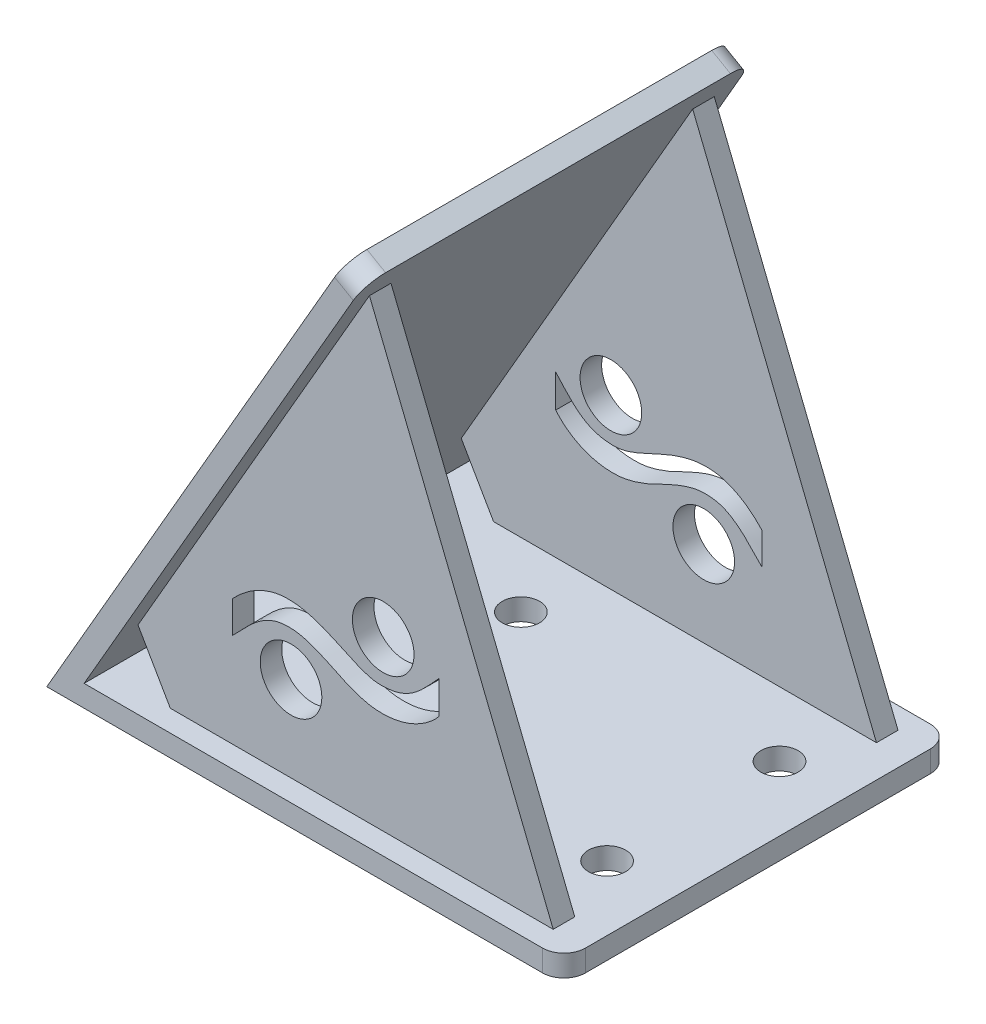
ISO-10303-21;
HEADER;
FILE_DESCRIPTION(('STEP AP214'),'2;1');
FILE_NAME('part.step','',(''),(''),'','','');
FILE_SCHEMA(('AUTOMOTIVE_DESIGN { 1 0 10303 214 1 1 1 1 }'));
ENDSEC;
DATA;
#1=APPLICATION_CONTEXT('core data for automotive mechanical design processes');
#2=APPLICATION_PROTOCOL_DEFINITION('international standard','automotive_design',2000,#1);
#3=PRODUCT_CONTEXT('',#1,'mechanical');
#4=PRODUCT('Part','Part','',(#3));
#5=PRODUCT_RELATED_PRODUCT_CATEGORY('part','',(#4));
#6=PRODUCT_DEFINITION_FORMATION('','',#4);
#7=PRODUCT_DEFINITION_CONTEXT('part definition',#1,'design');
#8=PRODUCT_DEFINITION('design','',#6,#7);
#9=PRODUCT_DEFINITION_SHAPE('','',#8);
#10=(LENGTH_UNIT() NAMED_UNIT(*) SI_UNIT(.MILLI.,.METRE.));
#11=(NAMED_UNIT(*) PLANE_ANGLE_UNIT() SI_UNIT($,.RADIAN.));
#12=(NAMED_UNIT(*) SI_UNIT($,.STERADIAN.) SOLID_ANGLE_UNIT());
#13=UNCERTAINTY_MEASURE_WITH_UNIT(LENGTH_MEASURE(1.E-05),#10,'distance_accuracy_value','');
#14=(GEOMETRIC_REPRESENTATION_CONTEXT(3) GLOBAL_UNCERTAINTY_ASSIGNED_CONTEXT((#13)) GLOBAL_UNIT_ASSIGNED_CONTEXT((#10,
#11,#12)) REPRESENTATION_CONTEXT('',''));
#15=CARTESIAN_POINT('',(0.,0.,0.));
#16=DIRECTION('',(0.,0.,1.));
#17=DIRECTION('',(1.,0.,0.));
#18=AXIS2_PLACEMENT_3D('',#15,#16,#17);
#19=CARTESIAN_POINT('',(10.9985226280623,6.35,57.15));
#20=DIRECTION('',(0.,-1.,0.));
#21=DIRECTION('',(0.,0.,-1.));
#22=AXIS2_PLACEMENT_3D('',#19,#20,#21);
#23=PLANE('',#22);
#24=CARTESIAN_POINT('',(57.15,6.35,-25.4));
#25=DIRECTION('',(0.,-1.,0.));
#26=DIRECTION('',(0.,0.,-1.));
#27=AXIS2_PLACEMENT_3D('',#24,#25,#26);
#28=CIRCLE('',#27,5.49999999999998);
#29=CARTESIAN_POINT('',(57.15,6.35,-30.9));
#30=VERTEX_POINT('',#29);
#31=EDGE_CURVE('E875',#30,#30,#28,.T.);
#32=ORIENTED_EDGE('',*,*,#31,.T.);
#33=EDGE_LOOP('',(#32));
#34=FACE_BOUND('',#33,.T.);
#35=CARTESIAN_POINT('',(57.15,6.35,25.4));
#36=DIRECTION('',(0.,-1.,0.));
#37=DIRECTION('',(0.,0.,-1.));
#38=AXIS2_PLACEMENT_3D('',#35,#36,#37);
#39=CIRCLE('',#38,5.49999999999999);
#40=CARTESIAN_POINT('',(57.15,6.35,19.9));
#41=VERTEX_POINT('',#40);
#42=EDGE_CURVE('E882',#41,#41,#39,.T.);
#43=ORIENTED_EDGE('',*,*,#42,.T.);
#44=EDGE_LOOP('',(#43));
#45=FACE_BOUND('',#44,.T.);
#46=CARTESIAN_POINT('',(133.35,6.35,25.4));
#47=DIRECTION('',(0.,-1.,0.));
#48=DIRECTION('',(0.,0.,-1.));
#49=AXIS2_PLACEMENT_3D('',#46,#47,#48);
#50=CIRCLE('',#49,5.49999999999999);
#51=CARTESIAN_POINT('',(133.35,6.35,19.9));
#52=VERTEX_POINT('',#51);
#53=EDGE_CURVE('E636',#52,#52,#50,.T.);
#54=ORIENTED_EDGE('',*,*,#53,.T.);
#55=EDGE_LOOP('',(#54));
#56=FACE_BOUND('',#55,.T.);
#57=CARTESIAN_POINT('',(133.35,6.35,-25.4));
#58=DIRECTION('',(0.,-1.,0.));
#59=DIRECTION('',(0.,0.,-1.));
#60=AXIS2_PLACEMENT_3D('',#57,#58,#59);
#61=CIRCLE('',#60,5.49999999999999);
#62=CARTESIAN_POINT('',(133.35,6.35,-30.9));
#63=VERTEX_POINT('',#62);
#64=EDGE_CURVE('E635',#63,#63,#61,.T.);
#65=ORIENTED_EDGE('',*,*,#64,.T.);
#66=EDGE_LOOP('',(#65));
#67=FACE_BOUND('',#66,.T.);
#68=DIRECTION('',(-1.,0.,0.));
#69=VECTOR('',#68,1.);
#70=CARTESIAN_POINT('',(10.9985226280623,6.35,57.15));
#71=LINE('',#70,#69);
#72=CARTESIAN_POINT('',(146.05,6.35,57.15));
#73=VERTEX_POINT('',#72);
#74=CARTESIAN_POINT('',(10.9985226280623,6.35,57.15));
#75=VERTEX_POINT('',#74);
#76=EDGE_CURVE('E482',#73,#75,#71,.T.);
#77=ORIENTED_EDGE('',*,*,#76,.F.);
#78=CARTESIAN_POINT('',(146.05,6.35,50.8));
#79=DIRECTION('',(0.,-1.,0.));
#80=DIRECTION('',(0.,0.,-1.));
#81=AXIS2_PLACEMENT_3D('',#78,#79,#80);
#82=CIRCLE('',#81,6.35);
#83=CARTESIAN_POINT('',(152.4,6.35,50.8));
#84=VERTEX_POINT('',#83);
#85=EDGE_CURVE('E524',#73,#84,#82,.F.);
#86=ORIENTED_EDGE('',*,*,#85,.T.);
#87=DIRECTION('',(0.,0.,-1.));
#88=VECTOR('',#87,1.);
#89=CARTESIAN_POINT('',(152.4,6.35,57.15));
#90=LINE('',#89,#88);
#91=CARTESIAN_POINT('',(152.4,6.35,-50.8));
#92=VERTEX_POINT('',#91);
#93=EDGE_CURVE('E510',#84,#92,#90,.T.);
#94=ORIENTED_EDGE('',*,*,#93,.T.);
#95=CARTESIAN_POINT('',(146.05,6.35,-50.8));
#96=DIRECTION('',(0.,-1.,0.));
#97=DIRECTION('',(0.,0.,-1.));
#98=AXIS2_PLACEMENT_3D('',#95,#96,#97);
#99=CIRCLE('',#98,6.35);
#100=CARTESIAN_POINT('',(146.05,6.35,-57.15));
#101=VERTEX_POINT('',#100);
#102=EDGE_CURVE('E522',#92,#101,#99,.F.);
#103=ORIENTED_EDGE('',*,*,#102,.T.);
#104=DIRECTION('',(-1.,0.,0.));
#105=VECTOR('',#104,1.);
#106=CARTESIAN_POINT('',(10.9985226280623,6.35,-57.15));
#107=LINE('',#106,#105);
#108=CARTESIAN_POINT('',(10.9985226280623,6.35,-57.15));
#109=VERTEX_POINT('',#108);
#110=EDGE_CURVE('E493',#101,#109,#107,.T.);
#111=ORIENTED_EDGE('',*,*,#110,.T.);
#112=DIRECTION('',(0.,0.,-1.));
#113=VECTOR('',#112,1.);
#114=CARTESIAN_POINT('',(10.9985226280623,6.35,57.15));
#115=LINE('',#114,#113);
#116=EDGE_CURVE('E507',#75,#109,#115,.T.);
#117=ORIENTED_EDGE('',*,*,#116,.F.);
#118=EDGE_LOOP('',(#77,#86,#94,#103,#111,#117));
#119=FACE_BOUND('',#118,.T.);
#120=DIRECTION('',(0.,0.,-1.));
#121=VECTOR('',#120,1.);
#122=CARTESIAN_POINT('',(142.875,6.35000000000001,50.8));
#123=LINE('',#122,#121);
#124=CARTESIAN_POINT('',(142.875,6.35,50.8));
#125=VERTEX_POINT('',#124);
#126=CARTESIAN_POINT('',(142.875,6.35,44.45));
#127=VERTEX_POINT('',#126);
#128=EDGE_CURVE('E462',#125,#127,#123,.T.);
#129=ORIENTED_EDGE('',*,*,#128,.F.);
#130=DIRECTION('',(1.,0.,0.));
#131=VECTOR('',#130,1.);
#132=CARTESIAN_POINT('',(0.,6.35,50.8));
#133=LINE('',#132,#131);
#134=CARTESIAN_POINT('',(30.0485226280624,6.35,50.8));
#135=VERTEX_POINT('',#134);
#136=EDGE_CURVE('E681',#135,#125,#133,.T.);
#137=ORIENTED_EDGE('',*,*,#136,.F.);
#138=DIRECTION('',(0.,0.,-1.));
#139=VECTOR('',#138,1.);
#140=CARTESIAN_POINT('',(30.0485226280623,6.35,50.8));
#141=LINE('',#140,#139);
#142=CARTESIAN_POINT('',(30.0485226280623,6.35,44.45));
#143=VERTEX_POINT('',#142);
#144=EDGE_CURVE('E414',#135,#143,#141,.T.);
#145=ORIENTED_EDGE('',*,*,#144,.T.);
#146=DIRECTION('',(1.,0.,0.));
#147=VECTOR('',#146,1.);
#148=CARTESIAN_POINT('',(0.,6.35,44.45));
#149=LINE('',#148,#147);
#150=EDGE_CURVE('E427',#143,#127,#149,.T.);
#151=ORIENTED_EDGE('',*,*,#150,.T.);
#152=EDGE_LOOP('',(#129,#137,#145,#151));
#153=FACE_BOUND('',#152,.T.);
#154=DIRECTION('',(1.,0.,0.));
#155=VECTOR('',#154,1.);
#156=CARTESIAN_POINT('',(30.0485226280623,6.35,-50.8));
#157=LINE('',#156,#155);
#158=CARTESIAN_POINT('',(30.0485226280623,6.35,-50.8));
#159=VERTEX_POINT('',#158);
#160=CARTESIAN_POINT('',(142.875,6.35000000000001,-50.8));
#161=VERTEX_POINT('',#160);
#162=EDGE_CURVE('E648',#159,#161,#157,.T.);
#163=ORIENTED_EDGE('',*,*,#162,.T.);
#164=DIRECTION('',(0.,0.,1.));
#165=VECTOR('',#164,1.);
#166=CARTESIAN_POINT('',(142.875,6.35000000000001,-50.8));
#167=LINE('',#166,#165);
#168=CARTESIAN_POINT('',(142.875,6.35000000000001,-44.45));
#169=VERTEX_POINT('',#168);
#170=EDGE_CURVE('E671',#161,#169,#167,.T.);
#171=ORIENTED_EDGE('',*,*,#170,.T.);
#172=DIRECTION('',(1.,0.,0.));
#173=VECTOR('',#172,1.);
#174=CARTESIAN_POINT('',(30.0485226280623,6.35,-44.45));
#175=LINE('',#174,#173);
#176=CARTESIAN_POINT('',(30.0485226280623,6.35,-44.45));
#177=VERTEX_POINT('',#176);
#178=EDGE_CURVE('E659',#177,#169,#175,.T.);
#179=ORIENTED_EDGE('',*,*,#178,.F.);
#180=DIRECTION('',(0.,0.,1.));
#181=VECTOR('',#180,1.);
#182=CARTESIAN_POINT('',(30.0485226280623,6.35,-50.8));
#183=LINE('',#182,#181);
#184=EDGE_CURVE('E657',#159,#177,#183,.T.);
#185=ORIENTED_EDGE('',*,*,#184,.F.);
#186=EDGE_LOOP('',(#163,#171,#179,#185));
#187=FACE_BOUND('',#186,.T.);
#188=ADVANCED_FACE('F97',(#34,#45,#56,#67,#119,#153,#187),#23,.F.);
#189=CARTESIAN_POINT('',(10.9985226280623,6.35,57.15));
#190=DIRECTION('',(-0.86602540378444,0.499999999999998,0.));
#191=DIRECTION('',(-0.499999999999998,-0.86602540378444,0.));
#192=AXIS2_PLACEMENT_3D('',#189,#190,#191);
#193=PLANE('',#192);
#194=DIRECTION('',(0.499999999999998,0.86602540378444,0.));
#195=VECTOR('',#194,1.);
#196=CARTESIAN_POINT('',(10.9985226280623,6.35,-57.15));
#197=LINE('',#196,#195);
#198=CARTESIAN_POINT('',(90.3124423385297,143.725738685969,-57.15));
#199=VERTEX_POINT('',#198);
#200=EDGE_CURVE('E495',#109,#199,#197,.T.);
#201=ORIENTED_EDGE('',*,*,#200,.T.);
#202=CARTESIAN_POINT('',(90.3124423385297,143.725738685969,-50.8));
#203=DIRECTION('',(-0.86602540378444,0.499999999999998,0.));
#204=DIRECTION('',(-0.499999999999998,-0.86602540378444,0.));
#205=AXIS2_PLACEMENT_3D('',#202,#203,#204);
#206=CIRCLE('',#205,6.35);
#207=CARTESIAN_POINT('',(93.4874423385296,149.225,-50.8));
#208=VERTEX_POINT('',#207);
#209=EDGE_CURVE('E14',#199,#208,#206,.F.);
#210=ORIENTED_EDGE('',*,*,#209,.T.);
#211=DIRECTION('',(0.,0.,-1.));
#212=VECTOR('',#211,1.);
#213=CARTESIAN_POINT('',(93.4874423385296,149.225,57.15));
#214=LINE('',#213,#212);
#215=CARTESIAN_POINT('',(93.4874423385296,149.225,50.8));
#216=VERTEX_POINT('',#215);
#217=EDGE_CURVE('E504',#216,#208,#214,.T.);
#218=ORIENTED_EDGE('',*,*,#217,.F.);
#219=CARTESIAN_POINT('',(90.3124423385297,143.725738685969,50.8));
#220=DIRECTION('',(-0.86602540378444,0.499999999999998,0.));
#221=DIRECTION('',(-0.499999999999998,-0.86602540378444,0.));
#222=AXIS2_PLACEMENT_3D('',#219,#220,#221);
#223=CIRCLE('',#222,6.35);
#224=CARTESIAN_POINT('',(90.3124423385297,143.725738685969,57.15));
#225=VERTEX_POINT('',#224);
#226=EDGE_CURVE('E105',#216,#225,#223,.F.);
#227=ORIENTED_EDGE('',*,*,#226,.T.);
#228=DIRECTION('',(0.499999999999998,0.86602540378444,0.));
#229=VECTOR('',#228,1.);
#230=CARTESIAN_POINT('',(10.9985226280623,6.35,57.15));
#231=LINE('',#230,#229);
#232=EDGE_CURVE('E485',#75,#225,#231,.T.);
#233=ORIENTED_EDGE('',*,*,#232,.F.);
#234=ORIENTED_EDGE('',*,*,#116,.T.);
#235=EDGE_LOOP('',(#201,#210,#218,#227,#233,#234));
#236=FACE_BOUND('',#235,.T.);
#237=DIRECTION('',(0.,0.,-1.));
#238=VECTOR('',#237,1.);
#239=CARTESIAN_POINT('',(20.5235226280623,22.8477839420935,50.8));
#240=LINE('',#239,#238);
#241=CARTESIAN_POINT('',(20.5235226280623,22.8477839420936,50.8));
#242=VERTEX_POINT('',#241);
#243=CARTESIAN_POINT('',(20.5235226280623,22.8477839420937,44.45));
#244=VERTEX_POINT('',#243);
#245=EDGE_CURVE('E472',#242,#244,#240,.T.);
#246=ORIENTED_EDGE('',*,*,#245,.F.);
#247=DIRECTION('',(-0.5,-0.866025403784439,0.));
#248=VECTOR('',#247,1.);
#249=CARTESIAN_POINT('',(5.49926131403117,-3.17499999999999,50.8));
#250=LINE('',#249,#248);
#251=CARTESIAN_POINT('',(88.7249423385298,140.976108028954,50.8));
#252=VERTEX_POINT('',#251);
#253=EDGE_CURVE('E687',#252,#242,#250,.T.);
#254=ORIENTED_EDGE('',*,*,#253,.F.);
#255=DIRECTION('',(0.,0.,-1.));
#256=VECTOR('',#255,1.);
#257=CARTESIAN_POINT('',(88.72494233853,140.976108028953,50.8));
#258=LINE('',#257,#256);
#259=CARTESIAN_POINT('',(88.72494233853,140.976108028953,44.45));
#260=VERTEX_POINT('',#259);
#261=EDGE_CURVE('E475',#252,#260,#258,.T.);
#262=ORIENTED_EDGE('',*,*,#261,.T.);
#263=DIRECTION('',(-0.5,-0.866025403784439,0.));
#264=VECTOR('',#263,1.);
#265=CARTESIAN_POINT('',(5.49926131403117,-3.17499999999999,44.45));
#266=LINE('',#265,#264);
#267=EDGE_CURVE('E432',#260,#244,#266,.T.);
#268=ORIENTED_EDGE('',*,*,#267,.T.);
#269=EDGE_LOOP('',(#246,#254,#262,#268));
#270=FACE_BOUND('',#269,.T.);
#271=DIRECTION('',(-0.5,-0.866025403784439,0.));
#272=VECTOR('',#271,1.);
#273=CARTESIAN_POINT('',(88.72494233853,140.976108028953,-50.8));
#274=LINE('',#273,#272);
#275=CARTESIAN_POINT('',(88.72494233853,140.976108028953,-50.8));
#276=VERTEX_POINT('',#275);
#277=CARTESIAN_POINT('',(20.5235226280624,22.8477839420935,-50.8));
#278=VERTEX_POINT('',#277);
#279=EDGE_CURVE('E654',#276,#278,#274,.T.);
#280=ORIENTED_EDGE('',*,*,#279,.T.);
#281=DIRECTION('',(0.,0.,1.));
#282=VECTOR('',#281,1.);
#283=CARTESIAN_POINT('',(20.5235226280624,22.8477839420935,-50.8));
#284=LINE('',#283,#282);
#285=CARTESIAN_POINT('',(20.5235226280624,22.8477839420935,-44.45));
#286=VERTEX_POINT('',#285);
#287=EDGE_CURVE('E424',#278,#286,#284,.T.);
#288=ORIENTED_EDGE('',*,*,#287,.T.);
#289=DIRECTION('',(-0.5,-0.866025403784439,0.));
#290=VECTOR('',#289,1.);
#291=CARTESIAN_POINT('',(88.72494233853,140.976108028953,-44.45));
#292=LINE('',#291,#290);
#293=CARTESIAN_POINT('',(88.7249423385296,140.976108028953,-44.45));
#294=VERTEX_POINT('',#293);
#295=EDGE_CURVE('E649',#294,#286,#292,.T.);
#296=ORIENTED_EDGE('',*,*,#295,.F.);
#297=DIRECTION('',(0.,0.,1.));
#298=VECTOR('',#297,1.);
#299=CARTESIAN_POINT('',(88.72494233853,140.976108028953,-50.8));
#300=LINE('',#299,#298);
#301=EDGE_CURVE('E668',#276,#294,#300,.T.);
#302=ORIENTED_EDGE('',*,*,#301,.F.);
#303=EDGE_LOOP('',(#280,#288,#296,#302));
#304=FACE_BOUND('',#303,.T.);
#305=ADVANCED_FACE('F551',(#236,#270,#304),#193,.F.);
#306=CARTESIAN_POINT('',(0.,0.,57.15));
#307=DIRECTION('',(0.,1.,0.));
#308=DIRECTION('',(0.,0.,1.));
#309=AXIS2_PLACEMENT_3D('',#306,#307,#308);
#310=PLANE('',#309);
#311=CARTESIAN_POINT('',(57.15,0.,-25.4));
#312=DIRECTION('',(0.,-1.,0.));
#313=DIRECTION('',(0.,0.,-1.));
#314=AXIS2_PLACEMENT_3D('',#311,#312,#313);
#315=CIRCLE('',#314,5.49999999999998);
#316=CARTESIAN_POINT('',(57.15,0.,-30.9));
#317=VERTEX_POINT('',#316);
#318=EDGE_CURVE('E622',#317,#317,#315,.T.);
#319=ORIENTED_EDGE('',*,*,#318,.F.);
#320=EDGE_LOOP('',(#319));
#321=FACE_BOUND('',#320,.T.);
#322=CARTESIAN_POINT('',(57.15,0.,25.4));
#323=DIRECTION('',(0.,-1.,0.));
#324=DIRECTION('',(0.,0.,-1.));
#325=AXIS2_PLACEMENT_3D('',#322,#323,#324);
#326=CIRCLE('',#325,5.49999999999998);
#327=CARTESIAN_POINT('',(57.15,0.,19.9));
#328=VERTEX_POINT('',#327);
#329=EDGE_CURVE('E626',#328,#328,#326,.T.);
#330=ORIENTED_EDGE('',*,*,#329,.F.);
#331=EDGE_LOOP('',(#330));
#332=FACE_BOUND('',#331,.T.);
#333=CARTESIAN_POINT('',(133.35,0.,25.4));
#334=DIRECTION('',(0.,-1.,0.));
#335=DIRECTION('',(0.,0.,-1.));
#336=AXIS2_PLACEMENT_3D('',#333,#334,#335);
#337=CIRCLE('',#336,5.49999999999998);
#338=CARTESIAN_POINT('',(133.35,0.,19.9));
#339=VERTEX_POINT('',#338);
#340=EDGE_CURVE('E630',#339,#339,#337,.T.);
#341=ORIENTED_EDGE('',*,*,#340,.F.);
#342=EDGE_LOOP('',(#341));
#343=FACE_BOUND('',#342,.T.);
#344=CARTESIAN_POINT('',(133.35,0.,-25.4));
#345=DIRECTION('',(0.,-1.,0.));
#346=DIRECTION('',(0.,0.,-1.));
#347=AXIS2_PLACEMENT_3D('',#344,#345,#346);
#348=CIRCLE('',#347,5.49999999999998);
#349=CARTESIAN_POINT('',(133.35,0.,-30.9));
#350=VERTEX_POINT('',#349);
#351=EDGE_CURVE('E633',#350,#350,#348,.T.);
#352=ORIENTED_EDGE('',*,*,#351,.F.);
#353=EDGE_LOOP('',(#352));
#354=FACE_BOUND('',#353,.T.);
#355=DIRECTION('',(0.,0.,-1.));
#356=VECTOR('',#355,1.);
#357=CARTESIAN_POINT('',(152.4,0.,57.15));
#358=LINE('',#357,#356);
#359=CARTESIAN_POINT('',(152.4,0.,50.8));
#360=VERTEX_POINT('',#359);
#361=CARTESIAN_POINT('',(152.4,0.,-50.8));
#362=VERTEX_POINT('',#361);
#363=EDGE_CURVE('E513',#360,#362,#358,.T.);
#364=ORIENTED_EDGE('',*,*,#363,.F.);
#365=CARTESIAN_POINT('',(146.05,0.,50.8));
#366=DIRECTION('',(0.,1.,0.));
#367=DIRECTION('',(0.,0.,1.));
#368=AXIS2_PLACEMENT_3D('',#365,#366,#367);
#369=CIRCLE('',#368,6.35);
#370=CARTESIAN_POINT('',(146.05,0.,57.15));
#371=VERTEX_POINT('',#370);
#372=EDGE_CURVE('E533',#360,#371,#369,.F.);
#373=ORIENTED_EDGE('',*,*,#372,.T.);
#374=DIRECTION('',(1.,0.,0.));
#375=VECTOR('',#374,1.);
#376=CARTESIAN_POINT('',(0.,0.,57.15));
#377=LINE('',#376,#375);
#378=CARTESIAN_POINT('',(0.,0.,57.15));
#379=VERTEX_POINT('',#378);
#380=EDGE_CURVE('E479',#379,#371,#377,.T.);
#381=ORIENTED_EDGE('',*,*,#380,.F.);
#382=DIRECTION('',(0.,0.,-1.));
#383=VECTOR('',#382,1.);
#384=CARTESIAN_POINT('',(0.,0.,57.15));
#385=LINE('',#384,#383);
#386=CARTESIAN_POINT('',(0.,0.,-57.15));
#387=VERTEX_POINT('',#386);
#388=EDGE_CURVE('E490',#379,#387,#385,.T.);
#389=ORIENTED_EDGE('',*,*,#388,.T.);
#390=DIRECTION('',(1.,0.,0.));
#391=VECTOR('',#390,1.);
#392=CARTESIAN_POINT('',(0.,0.,-57.15));
#393=LINE('',#392,#391);
#394=CARTESIAN_POINT('',(146.05,0.,-57.15));
#395=VERTEX_POINT('',#394);
#396=EDGE_CURVE('E470',#387,#395,#393,.T.);
#397=ORIENTED_EDGE('',*,*,#396,.T.);
#398=CARTESIAN_POINT('',(146.05,0.,-50.8));
#399=DIRECTION('',(0.,1.,0.));
#400=DIRECTION('',(0.,0.,1.));
#401=AXIS2_PLACEMENT_3D('',#398,#399,#400);
#402=CIRCLE('',#401,6.35);
#403=EDGE_CURVE('E531',#395,#362,#402,.F.);
#404=ORIENTED_EDGE('',*,*,#403,.T.);
#405=EDGE_LOOP('',(#364,#373,#381,#389,#397,#404));
#406=FACE_BOUND('',#405,.T.);
#407=ADVANCED_FACE('F582',(#321,#332,#343,#354,#406),#310,.F.);
#408=CARTESIAN_POINT('',(152.4,6.35,57.15));
#409=DIRECTION('',(-1.,0.,0.));
#410=DIRECTION('',(0.,0.,1.));
#411=AXIS2_PLACEMENT_3D('',#408,#409,#410);
#412=PLANE('',#411);
#413=ORIENTED_EDGE('',*,*,#93,.F.);
#414=DIRECTION('',(0.,1.,0.));
#415=VECTOR('',#414,1.);
#416=CARTESIAN_POINT('',(152.4,6.35,50.8));
#417=LINE('',#416,#415);
#418=EDGE_CURVE('E529',#84,#360,#417,.F.);
#419=ORIENTED_EDGE('',*,*,#418,.T.);
#420=ORIENTED_EDGE('',*,*,#363,.T.);
#421=DIRECTION('',(0.,1.,0.));
#422=VECTOR('',#421,1.);
#423=CARTESIAN_POINT('',(152.4,6.35,-50.8));
#424=LINE('',#423,#422);
#425=EDGE_CURVE('E526',#362,#92,#424,.T.);
#426=ORIENTED_EDGE('',*,*,#425,.T.);
#427=EDGE_LOOP('',(#413,#419,#420,#426));
#428=FACE_BOUND('',#427,.T.);
#429=ADVANCED_FACE('F589',(#428),#412,.F.);
#430=CARTESIAN_POINT('',(87.9881810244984,152.4,57.15));
#431=DIRECTION('',(-0.499999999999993,-0.866025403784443,0.));
#432=DIRECTION('',(0.866025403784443,-0.499999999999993,0.));
#433=AXIS2_PLACEMENT_3D('',#430,#431,#432);
#434=PLANE('',#433);
#435=ORIENTED_EDGE('',*,*,#217,.T.);
#436=DIRECTION('',(-0.866025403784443,0.499999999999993,0.));
#437=VECTOR('',#436,1.);
#438=CARTESIAN_POINT('',(87.9881810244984,152.4,-50.8));
#439=LINE('',#438,#437);
#440=CARTESIAN_POINT('',(87.9881810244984,152.4,-50.8));
#441=VERTEX_POINT('',#440);
#442=EDGE_CURVE('E541',#208,#441,#439,.T.);
#443=ORIENTED_EDGE('',*,*,#442,.T.);
#444=DIRECTION('',(0.,0.,-1.));
#445=VECTOR('',#444,1.);
#446=CARTESIAN_POINT('',(87.9881810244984,152.4,57.15));
#447=LINE('',#446,#445);
#448=CARTESIAN_POINT('',(87.9881810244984,152.4,50.8));
#449=VERTEX_POINT('',#448);
#450=EDGE_CURVE('E501',#449,#441,#447,.T.);
#451=ORIENTED_EDGE('',*,*,#450,.F.);
#452=DIRECTION('',(-0.866025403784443,0.499999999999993,0.));
#453=VECTOR('',#452,1.);
#454=CARTESIAN_POINT('',(87.9881810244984,152.4,50.8));
#455=LINE('',#454,#453);
#456=EDGE_CURVE('E539',#449,#216,#455,.F.);
#457=ORIENTED_EDGE('',*,*,#456,.T.);
#458=EDGE_LOOP('',(#435,#443,#451,#457));
#459=FACE_BOUND('',#458,.T.);
#460=ADVANCED_FACE('F566',(#459),#434,.F.);
#461=CARTESIAN_POINT('',(0.,0.,57.15));
#462=DIRECTION('',(0.86602540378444,-0.499999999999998,0.));
#463=DIRECTION('',(0.499999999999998,0.86602540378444,0.));
#464=AXIS2_PLACEMENT_3D('',#461,#462,#463);
#465=PLANE('',#464);
#466=ORIENTED_EDGE('',*,*,#450,.T.);
#467=CARTESIAN_POINT('',(84.8131810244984,146.900738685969,-50.8));
#468=DIRECTION('',(0.86602540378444,-0.499999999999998,0.));
#469=DIRECTION('',(0.499999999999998,0.86602540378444,0.));
#470=AXIS2_PLACEMENT_3D('',#467,#468,#469);
#471=CIRCLE('',#470,6.35);
#472=CARTESIAN_POINT('',(84.8131810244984,146.900738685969,-57.15));
#473=VERTEX_POINT('',#472);
#474=EDGE_CURVE('E546',#441,#473,#471,.F.);
#475=ORIENTED_EDGE('',*,*,#474,.T.);
#476=DIRECTION('',(-0.499999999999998,-0.86602540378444,0.));
#477=VECTOR('',#476,1.);
#478=CARTESIAN_POINT('',(0.,0.,-57.15));
#479=LINE('',#478,#477);
#480=EDGE_CURVE('E483',#473,#387,#479,.T.);
#481=ORIENTED_EDGE('',*,*,#480,.T.);
#482=ORIENTED_EDGE('',*,*,#388,.F.);
#483=DIRECTION('',(-0.499999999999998,-0.86602540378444,0.));
#484=VECTOR('',#483,1.);
#485=CARTESIAN_POINT('',(0.,0.,57.15));
#486=LINE('',#485,#484);
#487=CARTESIAN_POINT('',(84.8131810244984,146.900738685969,57.15));
#488=VERTEX_POINT('',#487);
#489=EDGE_CURVE('E488',#488,#379,#486,.T.);
#490=ORIENTED_EDGE('',*,*,#489,.F.);
#491=CARTESIAN_POINT('',(84.8131810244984,146.900738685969,50.8));
#492=DIRECTION('',(0.86602540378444,-0.499999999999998,0.));
#493=DIRECTION('',(0.499999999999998,0.86602540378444,0.));
#494=AXIS2_PLACEMENT_3D('',#491,#492,#493);
#495=CIRCLE('',#494,6.35);
#496=EDGE_CURVE('E544',#488,#449,#495,.F.);
#497=ORIENTED_EDGE('',*,*,#496,.T.);
#498=EDGE_LOOP('',(#466,#475,#481,#482,#490,#497));
#499=FACE_BOUND('',#498,.T.);
#500=ADVANCED_FACE('F563',(#499),#465,.F.);
#501=CARTESIAN_POINT('',(0.,0.,57.15));
#502=DIRECTION('',(0.,0.,-1.));
#503=DIRECTION('',(-1.,0.,0.));
#504=AXIS2_PLACEMENT_3D('',#501,#502,#503);
#505=PLANE('',#504);
#506=ORIENTED_EDGE('',*,*,#380,.T.);
#507=DIRECTION('',(0.,1.,0.));
#508=VECTOR('',#507,1.);
#509=CARTESIAN_POINT('',(146.05,0.,57.15));
#510=LINE('',#509,#508);
#511=EDGE_CURVE('E519',#371,#73,#510,.T.);
#512=ORIENTED_EDGE('',*,*,#511,.T.);
#513=ORIENTED_EDGE('',*,*,#76,.T.);
#514=ORIENTED_EDGE('',*,*,#232,.T.);
#515=DIRECTION('',(-0.866025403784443,0.499999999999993,0.));
#516=VECTOR('',#515,1.);
#517=CARTESIAN_POINT('',(84.8131810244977,146.900738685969,57.15));
#518=LINE('',#517,#516);
#519=EDGE_CURVE('E516',#225,#488,#518,.T.);
#520=ORIENTED_EDGE('',*,*,#519,.T.);
#521=ORIENTED_EDGE('',*,*,#489,.T.);
#522=EDGE_LOOP('',(#506,#512,#513,#514,#520,#521));
#523=FACE_BOUND('',#522,.T.);
#524=ADVANCED_FACE('F557',(#523),#505,.F.);
#525=CARTESIAN_POINT('',(0.,0.,-57.15));
#526=DIRECTION('',(0.,0.,-1.));
#527=DIRECTION('',(-1.,0.,0.));
#528=AXIS2_PLACEMENT_3D('',#525,#526,#527);
#529=PLANE('',#528);
#530=ORIENTED_EDGE('',*,*,#110,.F.);
#531=DIRECTION('',(0.,1.,0.));
#532=VECTOR('',#531,1.);
#533=CARTESIAN_POINT('',(146.05,0.,-57.15));
#534=LINE('',#533,#532);
#535=EDGE_CURVE('E537',#101,#395,#534,.F.);
#536=ORIENTED_EDGE('',*,*,#535,.T.);
#537=ORIENTED_EDGE('',*,*,#396,.F.);
#538=ORIENTED_EDGE('',*,*,#480,.F.);
#539=DIRECTION('',(-0.866025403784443,0.499999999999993,0.));
#540=VECTOR('',#539,1.);
#541=CARTESIAN_POINT('',(90.3124423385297,143.725738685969,-57.15));
#542=LINE('',#541,#540);
#543=EDGE_CURVE('E535',#473,#199,#542,.F.);
#544=ORIENTED_EDGE('',*,*,#543,.T.);
#545=ORIENTED_EDGE('',*,*,#200,.F.);
#546=EDGE_LOOP('',(#530,#536,#537,#538,#544,#545));
#547=FACE_BOUND('',#546,.T.);
#548=ADVANCED_FACE('F576',(#547),#529,.T.);
#549=CARTESIAN_POINT('',(48.4013129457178,0.,50.8));
#550=DIRECTION('',(-1.,0.,0.));
#551=DIRECTION('',(0.,0.,1.));
#552=AXIS2_PLACEMENT_3D('',#549,#550,#551);
#553=PLANE('',#552);
#554=DIRECTION('',(0.,1.,0.));
#555=VECTOR('',#554,1.);
#556=CARTESIAN_POINT('',(48.4013129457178,0.,44.45));
#557=LINE('',#556,#555);
#558=CARTESIAN_POINT('',(48.4013129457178,34.1165121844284,44.45));
#559=VERTEX_POINT('',#558);
#560=CARTESIAN_POINT('',(48.4013129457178,43.5202802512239,44.45));
#561=VERTEX_POINT('',#560);
#562=EDGE_CURVE('E437',#559,#561,#557,.T.);
#563=ORIENTED_EDGE('',*,*,#562,.T.);
#564=DIRECTION('',(0.,0.,-1.));
#565=VECTOR('',#564,1.);
#566=CARTESIAN_POINT('',(48.4013129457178,43.5202802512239,50.8));
#567=LINE('',#566,#565);
#568=CARTESIAN_POINT('',(48.4013129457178,43.5202802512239,50.8));
#569=VERTEX_POINT('',#568);
#570=EDGE_CURVE('E467',#569,#561,#567,.T.);
#571=ORIENTED_EDGE('',*,*,#570,.F.);
#572=DIRECTION('',(0.,1.,0.));
#573=VECTOR('',#572,1.);
#574=CARTESIAN_POINT('',(48.4013129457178,0.,50.8));
#575=LINE('',#574,#573);
#576=CARTESIAN_POINT('',(48.4013129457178,34.1165121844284,50.8));
#577=VERTEX_POINT('',#576);
#578=EDGE_CURVE('E693',#577,#569,#575,.T.);
#579=ORIENTED_EDGE('',*,*,#578,.F.);
#580=DIRECTION('',(0.,0.,-1.));
#581=VECTOR('',#580,1.);
#582=CARTESIAN_POINT('',(48.4013129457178,34.1165121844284,50.8));
#583=LINE('',#582,#581);
#584=EDGE_CURVE('E456',#577,#559,#583,.T.);
#585=ORIENTED_EDGE('',*,*,#584,.T.);
#586=EDGE_LOOP('',(#563,#571,#579,#585));
#587=FACE_BOUND('',#586,.T.);
#588=ADVANCED_FACE('F705',(#587),#553,.F.);
#589=CARTESIAN_POINT('',(48.4013129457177,43.5202802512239,50.8));
#590=CARTESIAN_POINT('',(50.0746237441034,45.3463456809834,50.8));
#591=CARTESIAN_POINT('',(52.9549755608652,47.8514315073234,50.8));
#592=CARTESIAN_POINT('',(57.6792119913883,50.3432515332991,50.8));
#593=CARTESIAN_POINT('',(61.0715431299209,51.3457648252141,50.8));
#594=CARTESIAN_POINT('',(65.0941610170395,51.7160114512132,50.8));
#595=CARTESIAN_POINT('',(68.5873741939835,51.4142469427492,50.8));
#596=CARTESIAN_POINT('',(72.2233329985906,50.4454483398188,50.8));
#597=CARTESIAN_POINT('',(75.1580345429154,49.4601235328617,50.8));
#598=CARTESIAN_POINT('',(78.258187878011,48.0990599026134,50.8));
#599=CARTESIAN_POINT('',(82.5079078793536,46.1178868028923,50.8));
#600=CARTESIAN_POINT('',(86.6543500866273,44.2316416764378,50.8));
#601=CARTESIAN_POINT('',(91.0175516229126,43.1698127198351,50.8));
#602=CARTESIAN_POINT('',(93.7004026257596,43.3102141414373,50.8));
#603=CARTESIAN_POINT('',(96.7950911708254,43.7126634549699,50.8));
#604=CARTESIAN_POINT('',(102.705111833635,45.8527697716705,50.8));
#605=CARTESIAN_POINT('',(106.46184498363,50.5815457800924,50.8));
#606=CARTESIAN_POINT('',(109.244127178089,53.5785202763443,50.8));
#607=B_SPLINE_CURVE_WITH_KNOTS('',3,(#589,#590,#591,#592,#593,#594,#595,#596,#597,#598,#599,
#600,#601,#602,#603,#604,#605,#606),.UNSPECIFIED.,.F.,.F.,(4,1,1,1,1,1,1,1,1,1,1,1,1,1,1,4),(0.,
0.108925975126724,0.165652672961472,0.233649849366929,0.262437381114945,0.342832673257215,
0.385729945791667,0.427580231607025,0.478646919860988,0.534280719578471,0.633626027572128,
0.678158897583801,0.72988904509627,0.750311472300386,0.815315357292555,1.),.UNSPECIFIED.);
#608=DIRECTION('',(0.,0.,-1.));
#609=VECTOR('',#608,1.);
#610=SURFACE_OF_LINEAR_EXTRUSION('',#607,#609);
#611=CARTESIAN_POINT('',(48.4013129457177,43.5202802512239,44.45));
#612=CARTESIAN_POINT('',(50.0746237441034,45.3463456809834,44.45));
#613=CARTESIAN_POINT('',(52.9549755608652,47.8514315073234,44.45));
#614=CARTESIAN_POINT('',(57.6792119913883,50.3432515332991,44.45));
#615=CARTESIAN_POINT('',(61.0715431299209,51.3457648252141,44.45));
#616=CARTESIAN_POINT('',(65.0941610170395,51.7160114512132,44.45));
#617=CARTESIAN_POINT('',(68.5873741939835,51.4142469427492,44.45));
#618=CARTESIAN_POINT('',(72.2233329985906,50.4454483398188,44.45));
#619=CARTESIAN_POINT('',(75.1580345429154,49.4601235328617,44.45));
#620=CARTESIAN_POINT('',(78.258187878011,48.0990599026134,44.45));
#621=CARTESIAN_POINT('',(82.5079078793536,46.1178868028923,44.45));
#622=CARTESIAN_POINT('',(86.6543500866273,44.2316416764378,44.45));
#623=CARTESIAN_POINT('',(91.0175516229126,43.1698127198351,44.45));
#624=CARTESIAN_POINT('',(93.7004026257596,43.3102141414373,44.45));
#625=CARTESIAN_POINT('',(96.7950911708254,43.7126634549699,44.45));
#626=CARTESIAN_POINT('',(102.705111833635,45.8527697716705,44.45));
#627=CARTESIAN_POINT('',(106.46184498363,50.5815457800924,44.45));
#628=CARTESIAN_POINT('',(109.244127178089,53.5785202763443,44.45));
#629=B_SPLINE_CURVE_WITH_KNOTS('',3,(#611,#612,#613,#614,#615,#616,#617,#618,#619,#620,#621,
#622,#623,#624,#625,#626,#627,#628),.UNSPECIFIED.,.F.,.F.,(4,1,1,1,1,1,1,1,1,1,1,1,1,1,1,4),(0.,
0.108925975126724,0.165652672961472,0.233649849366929,0.262437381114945,0.342832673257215,
0.385729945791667,0.427580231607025,0.478646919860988,0.534280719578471,0.633626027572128,
0.678158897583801,0.72988904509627,0.750311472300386,0.815315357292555,1.),.UNSPECIFIED.);
#630=CARTESIAN_POINT('',(109.244127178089,53.5785202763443,44.45));
#631=VERTEX_POINT('',#630);
#632=EDGE_CURVE('E440',#561,#631,#629,.T.);
#633=ORIENTED_EDGE('',*,*,#632,.T.);
#634=DIRECTION('',(0.,0.,-1.));
#635=VECTOR('',#634,1.);
#636=CARTESIAN_POINT('',(109.244127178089,53.5785202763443,50.8));
#637=LINE('',#636,#635);
#638=CARTESIAN_POINT('',(109.244127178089,53.5785202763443,50.8));
#639=VERTEX_POINT('',#638);
#640=EDGE_CURVE('E464',#639,#631,#637,.T.);
#641=ORIENTED_EDGE('',*,*,#640,.F.);
#642=EDGE_CURVE('E695',#569,#639,#607,.T.);
#643=ORIENTED_EDGE('',*,*,#642,.F.);
#644=ORIENTED_EDGE('',*,*,#570,.T.);
#645=EDGE_LOOP('',(#633,#641,#643,#644));
#646=FACE_BOUND('',#645,.T.);
#647=ADVANCED_FACE('F702',(#646),#610,.F.);
#648=CARTESIAN_POINT('',(109.244127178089,0.,50.8));
#649=DIRECTION('',(1.,0.,0.));
#650=DIRECTION('',(0.,0.,-1.));
#651=AXIS2_PLACEMENT_3D('',#648,#649,#650);
#652=PLANE('',#651);
#653=DIRECTION('',(0.,-1.,0.));
#654=VECTOR('',#653,1.);
#655=CARTESIAN_POINT('',(109.244127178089,0.,44.45));
#656=LINE('',#655,#654);
#657=CARTESIAN_POINT('',(109.244127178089,43.8599526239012,44.45));
#658=VERTEX_POINT('',#657);
#659=EDGE_CURVE('E444',#631,#658,#656,.T.);
#660=ORIENTED_EDGE('',*,*,#659,.T.);
#661=DIRECTION('',(0.,0.,-1.));
#662=VECTOR('',#661,1.);
#663=CARTESIAN_POINT('',(109.244127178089,43.8599526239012,50.8));
#664=LINE('',#663,#662);
#665=CARTESIAN_POINT('',(109.244127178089,43.8599526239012,50.8));
#666=VERTEX_POINT('',#665);
#667=EDGE_CURVE('E461',#666,#658,#664,.T.);
#668=ORIENTED_EDGE('',*,*,#667,.F.);
#669=DIRECTION('',(0.,-1.,0.));
#670=VECTOR('',#669,1.);
#671=CARTESIAN_POINT('',(109.244127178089,0.,50.8));
#672=LINE('',#671,#670);
#673=EDGE_CURVE('E415',#639,#666,#672,.T.);
#674=ORIENTED_EDGE('',*,*,#673,.F.);
#675=ORIENTED_EDGE('',*,*,#640,.T.);
#676=EDGE_LOOP('',(#660,#668,#674,#675));
#677=FACE_BOUND('',#676,.T.);
#678=ADVANCED_FACE('F405',(#677),#652,.F.);
#679=CARTESIAN_POINT('',(125.177278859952,50.3494973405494,50.8));
#680=DIRECTION('',(-0.927762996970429,-0.373169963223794,0.));
#681=DIRECTION('',(0.373169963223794,-0.927762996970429,0.));
#682=AXIS2_PLACEMENT_3D('',#679,#680,#681);
#683=PLANE('',#682);
#684=DIRECTION('',(-0.373169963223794,0.927762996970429,0.));
#685=VECTOR('',#684,1.);
#686=CARTESIAN_POINT('',(125.177278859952,50.3494973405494,44.45));
#687=LINE('',#686,#685);
#688=EDGE_CURVE('E429',#127,#260,#687,.T.);
#689=ORIENTED_EDGE('',*,*,#688,.T.);
#690=ORIENTED_EDGE('',*,*,#261,.F.);
#691=DIRECTION('',(-0.373169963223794,0.927762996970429,0.));
#692=VECTOR('',#691,1.);
#693=CARTESIAN_POINT('',(125.177278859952,50.3494973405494,50.8));
#694=LINE('',#693,#692);
#695=EDGE_CURVE('E684',#125,#252,#694,.T.);
#696=ORIENTED_EDGE('',*,*,#695,.F.);
#697=ORIENTED_EDGE('',*,*,#128,.T.);
#698=EDGE_LOOP('',(#689,#690,#696,#697));
#699=FACE_BOUND('',#698,.T.);
#700=ADVANCED_FACE('F714',(#699),#683,.F.);
#701=CARTESIAN_POINT('',(25.2860226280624,14.5988919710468,50.8));
#702=DIRECTION('',(0.866025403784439,0.5,0.));
#703=DIRECTION('',(-0.5,0.866025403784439,0.));
#704=AXIS2_PLACEMENT_3D('',#701,#702,#703);
#705=PLANE('',#704);
#706=DIRECTION('',(0.5,-0.866025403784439,0.));
#707=VECTOR('',#706,1.);
#708=CARTESIAN_POINT('',(25.2860226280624,14.5988919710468,44.45));
#709=LINE('',#708,#707);
#710=EDGE_CURVE('E434',#244,#143,#709,.T.);
#711=ORIENTED_EDGE('',*,*,#710,.T.);
#712=ORIENTED_EDGE('',*,*,#144,.F.);
#713=DIRECTION('',(0.5,-0.866025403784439,0.));
#714=VECTOR('',#713,1.);
#715=CARTESIAN_POINT('',(25.2860226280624,14.5988919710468,50.8));
#716=LINE('',#715,#714);
#717=EDGE_CURVE('E690',#242,#135,#716,.T.);
#718=ORIENTED_EDGE('',*,*,#717,.F.);
#719=ORIENTED_EDGE('',*,*,#245,.T.);
#720=EDGE_LOOP('',(#711,#712,#718,#719));
#721=FACE_BOUND('',#720,.T.);
#722=ADVANCED_FACE('F710',(#721),#705,.F.);
#723=CARTESIAN_POINT('',(92.7764152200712,55.893826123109,50.8));
#724=DIRECTION('',(0.,0.,-1.));
#725=DIRECTION('',(-1.,0.,0.));
#726=AXIS2_PLACEMENT_3D('',#723,#724,#725);
#727=CYLINDRICAL_SURFACE('',#726,9.0805);
#728=CARTESIAN_POINT('',(92.7764152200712,55.893826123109,50.8));
#729=DIRECTION('',(0.,0.,1.));
#730=DIRECTION('',(1.,0.,0.));
#731=AXIS2_PLACEMENT_3D('',#728,#729,#730);
#732=CIRCLE('',#731,9.0805);
#733=CARTESIAN_POINT('',(101.856915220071,55.893826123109,50.8));
#734=VERTEX_POINT('',#733);
#735=EDGE_CURVE('E678',#734,#734,#732,.T.);
#736=ORIENTED_EDGE('',*,*,#735,.T.);
#737=EDGE_LOOP('',(#736));
#738=FACE_BOUND('',#737,.T.);
#739=CARTESIAN_POINT('',(92.7764152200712,55.893826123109,44.45));
#740=DIRECTION('',(0.,0.,1.));
#741=DIRECTION('',(1.,0.,0.));
#742=AXIS2_PLACEMENT_3D('',#739,#740,#741);
#743=CIRCLE('',#742,9.0805);
#744=CARTESIAN_POINT('',(101.856915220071,55.893826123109,44.45));
#745=VERTEX_POINT('',#744);
#746=EDGE_CURVE('E423',#745,#745,#743,.T.);
#747=ORIENTED_EDGE('',*,*,#746,.F.);
#748=EDGE_LOOP('',(#747));
#749=FACE_BOUND('',#748,.T.);
#750=ADVANCED_FACE('F713',(#738,#749),#727,.F.);
#751=CARTESIAN_POINT('',(65.6174652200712,31.459026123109,50.8));
#752=DIRECTION('',(0.,0.,-1.));
#753=DIRECTION('',(-1.,0.,0.));
#754=AXIS2_PLACEMENT_3D('',#751,#752,#753);
#755=CYLINDRICAL_SURFACE('',#754,9.08049999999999);
#756=CARTESIAN_POINT('',(65.6174652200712,31.459026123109,50.8));
#757=DIRECTION('',(0.,0.,1.));
#758=DIRECTION('',(1.,0.,0.));
#759=AXIS2_PLACEMENT_3D('',#756,#757,#758);
#760=CIRCLE('',#759,9.08049999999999);
#761=CARTESIAN_POINT('',(74.6979652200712,31.459026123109,50.8));
#762=VERTEX_POINT('',#761);
#763=EDGE_CURVE('E455',#762,#762,#760,.T.);
#764=ORIENTED_EDGE('',*,*,#763,.T.);
#765=EDGE_LOOP('',(#764));
#766=FACE_BOUND('',#765,.T.);
#767=CARTESIAN_POINT('',(65.6174652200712,31.459026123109,44.45));
#768=DIRECTION('',(0.,0.,1.));
#769=DIRECTION('',(1.,0.,0.));
#770=AXIS2_PLACEMENT_3D('',#767,#768,#769);
#771=CIRCLE('',#770,9.08049999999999);
#772=CARTESIAN_POINT('',(74.6979652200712,31.459026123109,44.45));
#773=VERTEX_POINT('',#772);
#774=EDGE_CURVE('E417',#773,#773,#771,.T.);
#775=ORIENTED_EDGE('',*,*,#774,.F.);
#776=EDGE_LOOP('',(#775));
#777=FACE_BOUND('',#776,.T.);
#778=ADVANCED_FACE('F403',(#766,#777),#755,.F.);
#779=CARTESIAN_POINT('',(48.4013129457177,34.1165121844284,50.8));
#780=CARTESIAN_POINT('',(49.5420918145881,35.2696062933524,50.8));
#781=CARTESIAN_POINT('',(51.7325736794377,37.615585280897,50.8));
#782=CARTESIAN_POINT('',(54.6405512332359,40.5045207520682,50.8));
#783=CARTESIAN_POINT('',(57.2300401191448,42.3590211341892,50.8));
#784=CARTESIAN_POINT('',(59.4125003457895,43.555100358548,50.8));
#785=CARTESIAN_POINT('',(61.6301746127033,44.2827937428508,50.8));
#786=CARTESIAN_POINT('',(64.1052237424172,44.5815785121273,50.8));
#787=CARTESIAN_POINT('',(66.8230469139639,44.5722852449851,50.8));
#788=CARTESIAN_POINT('',(70.4655079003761,43.8183216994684,50.8));
#789=CARTESIAN_POINT('',(74.2393842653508,42.3117144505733,50.8));
#790=CARTESIAN_POINT('',(77.9911490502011,40.5979536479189,50.8));
#791=CARTESIAN_POINT('',(81.2095104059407,38.943860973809,50.8));
#792=CARTESIAN_POINT('',(85.2024931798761,37.3753457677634,50.8));
#793=CARTESIAN_POINT('',(88.7146233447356,36.4102747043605,50.8));
#794=CARTESIAN_POINT('',(92.3800928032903,36.1972289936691,50.8));
#795=CARTESIAN_POINT('',(99.4713041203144,36.4699019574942,50.8));
#796=CARTESIAN_POINT('',(105.83228930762,39.769103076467,50.8));
#797=CARTESIAN_POINT('',(109.244127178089,43.8599526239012,50.8));
#798=B_SPLINE_CURVE_WITH_KNOTS('',3,(#779,#780,#781,#782,#783,#784,#785,#786,#787,#788,#789,
#790,#791,#792,#793,#794,#795,#796,#797),.UNSPECIFIED.,.F.,.F.,(4,1,1,1,1,1,1,1,1,1,1,1,1,1,1,1,
4),(0.,0.0713891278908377,0.141557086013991,0.179922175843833,0.211273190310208,
0.250893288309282,0.281775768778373,0.320774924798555,0.370078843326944,0.444522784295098,
0.499232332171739,0.551810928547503,0.603701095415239,0.688211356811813,0.710383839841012,
0.765231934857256,1.),.UNSPECIFIED.);
#799=DIRECTION('',(0.,0.,-1.));
#800=VECTOR('',#799,1.);
#801=SURFACE_OF_LINEAR_EXTRUSION('',#798,#800);
#802=CARTESIAN_POINT('',(48.4013129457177,34.1165121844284,44.45));
#803=CARTESIAN_POINT('',(49.5420918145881,35.2696062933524,44.45));
#804=CARTESIAN_POINT('',(51.7325736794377,37.615585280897,44.45));
#805=CARTESIAN_POINT('',(54.6405512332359,40.5045207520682,44.45));
#806=CARTESIAN_POINT('',(57.2300401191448,42.3590211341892,44.45));
#807=CARTESIAN_POINT('',(59.4125003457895,43.555100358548,44.45));
#808=CARTESIAN_POINT('',(61.6301746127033,44.2827937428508,44.45));
#809=CARTESIAN_POINT('',(64.1052237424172,44.5815785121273,44.45));
#810=CARTESIAN_POINT('',(66.8230469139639,44.5722852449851,44.45));
#811=CARTESIAN_POINT('',(70.4655079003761,43.8183216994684,44.45));
#812=CARTESIAN_POINT('',(74.2393842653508,42.3117144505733,44.45));
#813=CARTESIAN_POINT('',(77.9911490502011,40.5979536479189,44.45));
#814=CARTESIAN_POINT('',(81.2095104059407,38.943860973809,44.45));
#815=CARTESIAN_POINT('',(85.2024931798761,37.3753457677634,44.45));
#816=CARTESIAN_POINT('',(88.7146233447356,36.4102747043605,44.45));
#817=CARTESIAN_POINT('',(92.3800928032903,36.1972289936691,44.45));
#818=CARTESIAN_POINT('',(99.4713041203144,36.4699019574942,44.45));
#819=CARTESIAN_POINT('',(105.83228930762,39.769103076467,44.45));
#820=CARTESIAN_POINT('',(109.244127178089,43.8599526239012,44.45));
#821=B_SPLINE_CURVE_WITH_KNOTS('',3,(#802,#803,#804,#805,#806,#807,#808,#809,#810,#811,#812,
#813,#814,#815,#816,#817,#818,#819,#820),.UNSPECIFIED.,.F.,.F.,(4,1,1,1,1,1,1,1,1,1,1,1,1,1,1,1,
4),(0.,0.0713891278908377,0.141557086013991,0.179922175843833,0.211273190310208,
0.250893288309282,0.281775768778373,0.320774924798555,0.370078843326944,0.444522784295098,
0.499232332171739,0.551810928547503,0.603701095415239,0.688211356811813,0.710383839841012,
0.765231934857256,1.),.UNSPECIFIED.);
#822=EDGE_CURVE('E450',#559,#658,#821,.T.);
#823=ORIENTED_EDGE('',*,*,#822,.F.);
#824=ORIENTED_EDGE('',*,*,#584,.F.);
#825=EDGE_CURVE('E407',#577,#666,#798,.T.);
#826=ORIENTED_EDGE('',*,*,#825,.T.);
#827=ORIENTED_EDGE('',*,*,#667,.T.);
#828=EDGE_LOOP('',(#823,#824,#826,#827));
#829=FACE_BOUND('',#828,.T.);
#830=ADVANCED_FACE('F395',(#829),#801,.T.);
#831=CARTESIAN_POINT('',(0.,0.,50.8));
#832=DIRECTION('',(0.,0.,1.));
#833=DIRECTION('',(1.,0.,0.));
#834=AXIS2_PLACEMENT_3D('',#831,#832,#833);
#835=PLANE('',#834);
#836=ORIENTED_EDGE('',*,*,#763,.F.);
#837=EDGE_LOOP('',(#836));
#838=FACE_BOUND('',#837,.T.);
#839=ORIENTED_EDGE('',*,*,#735,.F.);
#840=EDGE_LOOP('',(#839));
#841=FACE_BOUND('',#840,.T.);
#842=ORIENTED_EDGE('',*,*,#136,.T.);
#843=ORIENTED_EDGE('',*,*,#695,.T.);
#844=ORIENTED_EDGE('',*,*,#253,.T.);
#845=ORIENTED_EDGE('',*,*,#717,.T.);
#846=EDGE_LOOP('',(#842,#843,#844,#845));
#847=FACE_BOUND('',#846,.T.);
#848=ORIENTED_EDGE('',*,*,#578,.T.);
#849=ORIENTED_EDGE('',*,*,#642,.T.);
#850=ORIENTED_EDGE('',*,*,#673,.T.);
#851=ORIENTED_EDGE('',*,*,#825,.F.);
#852=EDGE_LOOP('',(#848,#849,#850,#851));
#853=FACE_BOUND('',#852,.T.);
#854=ADVANCED_FACE('F392',(#838,#841,#847,#853),#835,.T.);
#855=CARTESIAN_POINT('',(0.,0.,44.45));
#856=DIRECTION('',(0.,0.,1.));
#857=DIRECTION('',(1.,0.,0.));
#858=AXIS2_PLACEMENT_3D('',#855,#856,#857);
#859=PLANE('',#858);
#860=ORIENTED_EDGE('',*,*,#774,.T.);
#861=EDGE_LOOP('',(#860));
#862=FACE_BOUND('',#861,.T.);
#863=ORIENTED_EDGE('',*,*,#746,.T.);
#864=EDGE_LOOP('',(#863));
#865=FACE_BOUND('',#864,.T.);
#866=ORIENTED_EDGE('',*,*,#150,.F.);
#867=ORIENTED_EDGE('',*,*,#710,.F.);
#868=ORIENTED_EDGE('',*,*,#267,.F.);
#869=ORIENTED_EDGE('',*,*,#688,.F.);
#870=EDGE_LOOP('',(#866,#867,#868,#869));
#871=FACE_BOUND('',#870,.T.);
#872=ORIENTED_EDGE('',*,*,#562,.F.);
#873=ORIENTED_EDGE('',*,*,#822,.T.);
#874=ORIENTED_EDGE('',*,*,#659,.F.);
#875=ORIENTED_EDGE('',*,*,#632,.F.);
#876=EDGE_LOOP('',(#872,#873,#874,#875));
#877=FACE_BOUND('',#876,.T.);
#878=ADVANCED_FACE('F390',(#862,#865,#871,#877),#859,.F.);
#879=CARTESIAN_POINT('',(20.5235226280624,22.8477839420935,-50.8));
#880=DIRECTION('',(-0.866025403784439,-0.5,0.));
#881=DIRECTION('',(0.5,-0.866025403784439,0.));
#882=AXIS2_PLACEMENT_3D('',#879,#880,#881);
#883=PLANE('',#882);
#884=DIRECTION('',(0.5,-0.866025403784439,0.));
#885=VECTOR('',#884,1.);
#886=CARTESIAN_POINT('',(20.5235226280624,22.8477839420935,-44.45));
#887=LINE('',#886,#885);
#888=EDGE_CURVE('E639',#286,#177,#887,.T.);
#889=ORIENTED_EDGE('',*,*,#888,.F.);
#890=ORIENTED_EDGE('',*,*,#287,.F.);
#891=DIRECTION('',(0.5,-0.866025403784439,0.));
#892=VECTOR('',#891,1.);
#893=CARTESIAN_POINT('',(20.5235226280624,22.8477839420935,-50.8));
#894=LINE('',#893,#892);
#895=EDGE_CURVE('E645',#278,#159,#894,.T.);
#896=ORIENTED_EDGE('',*,*,#895,.T.);
#897=ORIENTED_EDGE('',*,*,#184,.T.);
#898=EDGE_LOOP('',(#889,#890,#896,#897));
#899=FACE_BOUND('',#898,.T.);
#900=ADVANCED_FACE('F386',(#899),#883,.T.);
#901=CARTESIAN_POINT('',(142.875,6.35000000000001,-50.8));
#902=DIRECTION('',(0.927762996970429,0.373169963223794,0.));
#903=DIRECTION('',(-0.373169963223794,0.927762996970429,0.));
#904=AXIS2_PLACEMENT_3D('',#901,#902,#903);
#905=PLANE('',#904);
#906=DIRECTION('',(-0.373169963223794,0.927762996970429,0.));
#907=VECTOR('',#906,1.);
#908=CARTESIAN_POINT('',(142.875,6.35000000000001,-44.45));
#909=LINE('',#908,#907);
#910=EDGE_CURVE('E662',#169,#294,#909,.T.);
#911=ORIENTED_EDGE('',*,*,#910,.F.);
#912=ORIENTED_EDGE('',*,*,#170,.F.);
#913=DIRECTION('',(-0.373169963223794,0.927762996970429,0.));
#914=VECTOR('',#913,1.);
#915=CARTESIAN_POINT('',(142.875,6.35000000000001,-50.8));
#916=LINE('',#915,#914);
#917=EDGE_CURVE('E652',#161,#276,#916,.T.);
#918=ORIENTED_EDGE('',*,*,#917,.T.);
#919=ORIENTED_EDGE('',*,*,#301,.T.);
#920=EDGE_LOOP('',(#911,#912,#918,#919));
#921=FACE_BOUND('',#920,.T.);
#922=ADVANCED_FACE('F378',(#921),#905,.T.);
#923=CARTESIAN_POINT('',(0.,0.,-50.8));
#924=DIRECTION('',(0.,0.,1.));
#925=DIRECTION('',(1.,0.,0.));
#926=AXIS2_PLACEMENT_3D('',#923,#924,#925);
#927=PLANE('',#926);
#928=CARTESIAN_POINT('',(64.6149603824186,55.893826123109,-50.8));
#929=DIRECTION('',(0.,0.,-1.));
#930=DIRECTION('',(-1.,0.,0.));
#931=AXIS2_PLACEMENT_3D('',#928,#929,#930);
#932=CIRCLE('',#931,9.0805);
#933=CARTESIAN_POINT('',(55.5344603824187,55.893826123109,-50.8));
#934=VERTEX_POINT('',#933);
#935=EDGE_CURVE('E295',#934,#934,#932,.T.);
#936=ORIENTED_EDGE('',*,*,#935,.F.);
#937=EDGE_LOOP('',(#936));
#938=FACE_BOUND('',#937,.T.);
#939=DIRECTION('',(0.,-1.,0.));
#940=VECTOR('',#939,1.);
#941=CARTESIAN_POINT('',(48.3605836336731,0.,-50.8));
#942=LINE('',#941,#940);
#943=CARTESIAN_POINT('',(48.3605836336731,53.6917264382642,-50.8));
#944=VERTEX_POINT('',#943);
#945=CARTESIAN_POINT('',(48.3605836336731,43.9731587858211,-50.8));
#946=VERTEX_POINT('',#945);
#947=EDGE_CURVE('E310',#944,#946,#942,.T.);
#948=ORIENTED_EDGE('',*,*,#947,.T.);
#949=CARTESIAN_POINT('',(109.203397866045,34.2297183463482,-50.8));
#950=CARTESIAN_POINT('',(108.062618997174,35.3828124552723,-50.8));
#951=CARTESIAN_POINT('',(105.872137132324,37.7287914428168,-50.8));
#952=CARTESIAN_POINT('',(102.964159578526,40.6177269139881,-50.8));
#953=CARTESIAN_POINT('',(100.374670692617,42.4722272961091,-50.8));
#954=CARTESIAN_POINT('',(98.1922104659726,43.6683065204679,-50.8));
#955=CARTESIAN_POINT('',(95.9745361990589,44.3959999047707,-50.8));
#956=CARTESIAN_POINT('',(93.499487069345,44.6947846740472,-50.8));
#957=CARTESIAN_POINT('',(90.7816638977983,44.685491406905,-50.8));
#958=CARTESIAN_POINT('',(87.1392029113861,43.9315278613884,-50.8));
#959=CARTESIAN_POINT('',(83.3653265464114,42.4249206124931,-50.8));
#960=CARTESIAN_POINT('',(79.613561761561,40.7111598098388,-50.8));
#961=CARTESIAN_POINT('',(76.3952004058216,39.0570671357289,-50.8));
#962=CARTESIAN_POINT('',(72.4022176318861,37.4885519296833,-50.8));
#963=CARTESIAN_POINT('',(68.8900874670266,36.5234808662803,-50.8));
#964=CARTESIAN_POINT('',(65.2246180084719,36.310435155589,-50.8));
#965=CARTESIAN_POINT('',(58.1334066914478,36.5831081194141,-50.8));
#966=CARTESIAN_POINT('',(51.7724215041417,39.8823092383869,-50.8));
#967=CARTESIAN_POINT('',(48.3605836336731,43.9731587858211,-50.8));
#968=B_SPLINE_CURVE_WITH_KNOTS('',3,(#949,#950,#951,#952,#953,#954,#955,#956,#957,#958,#959,
#960,#961,#962,#963,#964,#965,#966,#967),.UNSPECIFIED.,.F.,.F.,(4,1,1,1,1,1,1,1,1,1,1,1,1,1,1,1,
4),(0.,0.0713891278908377,0.141557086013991,0.179922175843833,0.211273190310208,
0.250893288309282,0.281775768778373,0.320774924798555,0.370078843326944,0.444522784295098,
0.499232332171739,0.551810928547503,0.603701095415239,0.688211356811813,0.710383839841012,
0.765231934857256,1.),.UNSPECIFIED.);
#969=CARTESIAN_POINT('',(109.203397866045,34.2297183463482,-50.8));
#970=VERTEX_POINT('',#969);
#971=EDGE_CURVE('E288',#970,#946,#968,.T.);
#972=ORIENTED_EDGE('',*,*,#971,.F.);
#973=DIRECTION('',(0.,1.,0.));
#974=VECTOR('',#973,1.);
#975=CARTESIAN_POINT('',(109.203397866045,0.,-50.8));
#976=LINE('',#975,#974);
#977=CARTESIAN_POINT('',(109.203397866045,43.6334864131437,-50.8));
#978=VERTEX_POINT('',#977);
#979=EDGE_CURVE('E307',#970,#978,#976,.T.);
#980=ORIENTED_EDGE('',*,*,#979,.T.);
#981=CARTESIAN_POINT('',(109.203397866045,43.6334864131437,-50.8));
#982=CARTESIAN_POINT('',(107.530087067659,45.4595518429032,-50.8));
#983=CARTESIAN_POINT('',(104.649735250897,47.9646376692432,-50.8));
#984=CARTESIAN_POINT('',(99.9254988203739,50.4564576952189,-50.8));
#985=CARTESIAN_POINT('',(96.5331676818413,51.458970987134,-50.8));
#986=CARTESIAN_POINT('',(92.5105497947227,51.829217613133,-50.8));
#987=CARTESIAN_POINT('',(89.0173366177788,51.5274531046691,-50.8));
#988=CARTESIAN_POINT('',(85.3813778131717,50.5586545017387,-50.8));
#989=CARTESIAN_POINT('',(82.4466762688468,49.5733296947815,-50.8));
#990=CARTESIAN_POINT('',(79.3465229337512,48.2122660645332,-50.8));
#991=CARTESIAN_POINT('',(75.0968029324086,46.2310929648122,-50.8));
#992=CARTESIAN_POINT('',(70.950360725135,44.3448478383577,-50.8));
#993=CARTESIAN_POINT('',(66.5871591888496,43.283018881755,-50.8));
#994=CARTESIAN_POINT('',(63.9043081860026,43.4234203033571,-50.8));
#995=CARTESIAN_POINT('',(60.8096196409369,43.8258696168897,-50.8));
#996=CARTESIAN_POINT('',(54.8995989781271,45.9659759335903,-50.8));
#997=CARTESIAN_POINT('',(51.1428658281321,50.6947519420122,-50.8));
#998=CARTESIAN_POINT('',(48.3605836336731,53.6917264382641,-50.8));
#999=B_SPLINE_CURVE_WITH_KNOTS('',3,(#981,#982,#983,#984,#985,#986,#987,#988,#989,#990,#991,
#992,#993,#994,#995,#996,#997,#998),.UNSPECIFIED.,.F.,.F.,(4,1,1,1,1,1,1,1,1,1,1,1,1,1,1,4),(0.,
0.108925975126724,0.165652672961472,0.233649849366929,0.262437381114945,0.342832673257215,
0.385729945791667,0.427580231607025,0.478646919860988,0.534280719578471,0.633626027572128,
0.678158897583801,0.72988904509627,0.750311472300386,0.815315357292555,1.),.UNSPECIFIED.);
#1000=EDGE_CURVE('E112',#978,#944,#999,.T.);
#1001=ORIENTED_EDGE('',*,*,#1000,.T.);
#1002=EDGE_LOOP('',(#948,#972,#980,#1001));
#1003=FACE_BOUND('',#1002,.T.);
#1004=CARTESIAN_POINT('',(91.987245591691,31.5722322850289,-50.8));
#1005=DIRECTION('',(0.,0.,-1.));
#1006=DIRECTION('',(-1.,0.,0.));
#1007=AXIS2_PLACEMENT_3D('',#1004,#1005,#1006);
#1008=CIRCLE('',#1007,9.0805);
#1009=CARTESIAN_POINT('',(82.906745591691,31.5722322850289,-50.8));
#1010=VERTEX_POINT('',#1009);
#1011=EDGE_CURVE('E863',#1010,#1010,#1008,.T.);
#1012=ORIENTED_EDGE('',*,*,#1011,.F.);
#1013=EDGE_LOOP('',(#1012));
#1014=FACE_BOUND('',#1013,.T.);
#1015=ORIENTED_EDGE('',*,*,#895,.F.);
#1016=ORIENTED_EDGE('',*,*,#279,.F.);
#1017=ORIENTED_EDGE('',*,*,#917,.F.);
#1018=ORIENTED_EDGE('',*,*,#162,.F.);
#1019=EDGE_LOOP('',(#1015,#1016,#1017,#1018));
#1020=FACE_BOUND('',#1019,.T.);
#1021=ADVANCED_FACE('F375',(#938,#1003,#1014,#1020),#927,.F.);
#1022=CARTESIAN_POINT('',(0.,0.,-44.45));
#1023=DIRECTION('',(0.,0.,1.));
#1024=DIRECTION('',(1.,0.,0.));
#1025=AXIS2_PLACEMENT_3D('',#1022,#1023,#1024);
#1026=PLANE('',#1025);
#1027=CARTESIAN_POINT('',(64.6149603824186,55.893826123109,-44.45));
#1028=DIRECTION('',(0.,0.,1.));
#1029=DIRECTION('',(1.,0.,0.));
#1030=AXIS2_PLACEMENT_3D('',#1027,#1028,#1029);
#1031=CIRCLE('',#1030,9.0805);
#1032=CARTESIAN_POINT('',(73.6954603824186,55.893826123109,-44.45));
#1033=VERTEX_POINT('',#1032);
#1034=EDGE_CURVE('E301',#1033,#1033,#1031,.F.);
#1035=ORIENTED_EDGE('',*,*,#1034,.T.);
#1036=EDGE_LOOP('',(#1035));
#1037=FACE_BOUND('',#1036,.T.);
#1038=CARTESIAN_POINT('',(109.203397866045,34.2297183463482,-44.45));
#1039=CARTESIAN_POINT('',(108.062618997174,35.3828124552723,-44.45));
#1040=CARTESIAN_POINT('',(105.872137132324,37.7287914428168,-44.45));
#1041=CARTESIAN_POINT('',(102.964159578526,40.6177269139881,-44.45));
#1042=CARTESIAN_POINT('',(100.374670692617,42.4722272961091,-44.45));
#1043=CARTESIAN_POINT('',(98.1922104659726,43.6683065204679,-44.45));
#1044=CARTESIAN_POINT('',(95.9745361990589,44.3959999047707,-44.45));
#1045=CARTESIAN_POINT('',(93.499487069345,44.6947846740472,-44.45));
#1046=CARTESIAN_POINT('',(90.7816638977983,44.685491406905,-44.45));
#1047=CARTESIAN_POINT('',(87.1392029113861,43.9315278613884,-44.45));
#1048=CARTESIAN_POINT('',(83.3653265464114,42.4249206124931,-44.45));
#1049=CARTESIAN_POINT('',(79.613561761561,40.7111598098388,-44.45));
#1050=CARTESIAN_POINT('',(76.3952004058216,39.0570671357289,-44.45));
#1051=CARTESIAN_POINT('',(72.4022176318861,37.4885519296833,-44.45));
#1052=CARTESIAN_POINT('',(68.8900874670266,36.5234808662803,-44.45));
#1053=CARTESIAN_POINT('',(65.2246180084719,36.310435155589,-44.45));
#1054=CARTESIAN_POINT('',(58.1334066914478,36.5831081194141,-44.45));
#1055=CARTESIAN_POINT('',(51.7724215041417,39.8823092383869,-44.45));
#1056=CARTESIAN_POINT('',(48.3605836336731,43.9731587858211,-44.45));
#1057=B_SPLINE_CURVE_WITH_KNOTS('',3,(#1038,#1039,#1040,#1041,#1042,#1043,#1044,#1045,#1046,
#1047,#1048,#1049,#1050,#1051,#1052,#1053,#1054,#1055,#1056),.UNSPECIFIED.,.F.,.F.,(4,1,1,1,1,1,
1,1,1,1,1,1,1,1,1,1,4),(0.,0.0713891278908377,0.141557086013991,0.179922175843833,
0.211273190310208,0.250893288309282,0.281775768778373,0.320774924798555,0.370078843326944,
0.444522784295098,0.499232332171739,0.551810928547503,0.603701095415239,0.688211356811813,
0.710383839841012,0.765231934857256,1.),.UNSPECIFIED.);
#1058=CARTESIAN_POINT('',(109.203397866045,34.2297183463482,-44.45));
#1059=VERTEX_POINT('',#1058);
#1060=CARTESIAN_POINT('',(48.3605836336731,43.9731587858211,-44.45));
#1061=VERTEX_POINT('',#1060);
#1062=EDGE_CURVE('E285',#1059,#1061,#1057,.T.);
#1063=ORIENTED_EDGE('',*,*,#1062,.T.);
#1064=DIRECTION('',(0.,-1.,0.));
#1065=VECTOR('',#1064,1.);
#1066=CARTESIAN_POINT('',(48.3605836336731,0.,-44.45));
#1067=LINE('',#1066,#1065);
#1068=CARTESIAN_POINT('',(48.3605836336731,53.6917264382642,-44.45));
#1069=VERTEX_POINT('',#1068);
#1070=EDGE_CURVE('E270',#1069,#1061,#1067,.T.);
#1071=ORIENTED_EDGE('',*,*,#1070,.F.);
#1072=CARTESIAN_POINT('',(109.203397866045,43.6334864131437,-44.45));
#1073=CARTESIAN_POINT('',(107.530087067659,45.4595518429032,-44.45));
#1074=CARTESIAN_POINT('',(104.649735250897,47.9646376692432,-44.45));
#1075=CARTESIAN_POINT('',(99.9254988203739,50.4564576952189,-44.45));
#1076=CARTESIAN_POINT('',(96.5331676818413,51.458970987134,-44.45));
#1077=CARTESIAN_POINT('',(92.5105497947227,51.829217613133,-44.45));
#1078=CARTESIAN_POINT('',(89.0173366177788,51.5274531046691,-44.45));
#1079=CARTESIAN_POINT('',(85.3813778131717,50.5586545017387,-44.45));
#1080=CARTESIAN_POINT('',(82.4466762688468,49.5733296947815,-44.45));
#1081=CARTESIAN_POINT('',(79.3465229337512,48.2122660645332,-44.45));
#1082=CARTESIAN_POINT('',(75.0968029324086,46.2310929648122,-44.45));
#1083=CARTESIAN_POINT('',(70.950360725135,44.3448478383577,-44.45));
#1084=CARTESIAN_POINT('',(66.5871591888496,43.283018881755,-44.45));
#1085=CARTESIAN_POINT('',(63.9043081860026,43.4234203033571,-44.45));
#1086=CARTESIAN_POINT('',(60.8096196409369,43.8258696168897,-44.45));
#1087=CARTESIAN_POINT('',(54.8995989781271,45.9659759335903,-44.45));
#1088=CARTESIAN_POINT('',(51.1428658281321,50.6947519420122,-44.45));
#1089=CARTESIAN_POINT('',(48.3605836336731,53.6917264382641,-44.45));
#1090=B_SPLINE_CURVE_WITH_KNOTS('',3,(#1072,#1073,#1074,#1075,#1076,#1077,#1078,#1079,#1080,
#1081,#1082,#1083,#1084,#1085,#1086,#1087,#1088,#1089),.UNSPECIFIED.,.F.,.F.,(4,1,1,1,1,1,1,1,1,
1,1,1,1,1,1,4),(0.,0.108925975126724,0.165652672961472,0.233649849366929,0.262437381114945,
0.342832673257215,0.385729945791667,0.427580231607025,0.478646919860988,0.534280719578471,
0.633626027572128,0.678158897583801,0.72988904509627,0.750311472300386,0.815315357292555,1.),.UNSPECIFIED.);
#1091=CARTESIAN_POINT('',(109.203397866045,43.6334864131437,-44.45));
#1092=VERTEX_POINT('',#1091);
#1093=EDGE_CURVE('E281',#1092,#1069,#1090,.T.);
#1094=ORIENTED_EDGE('',*,*,#1093,.F.);
#1095=DIRECTION('',(0.,1.,0.));
#1096=VECTOR('',#1095,1.);
#1097=CARTESIAN_POINT('',(109.203397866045,0.,-44.45));
#1098=LINE('',#1097,#1096);
#1099=EDGE_CURVE('E293',#1059,#1092,#1098,.T.);
#1100=ORIENTED_EDGE('',*,*,#1099,.F.);
#1101=EDGE_LOOP('',(#1063,#1071,#1094,#1100));
#1102=FACE_BOUND('',#1101,.T.);
#1103=CARTESIAN_POINT('',(91.987245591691,31.5722322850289,-44.45));
#1104=DIRECTION('',(0.,0.,1.));
#1105=DIRECTION('',(1.,0.,0.));
#1106=AXIS2_PLACEMENT_3D('',#1103,#1104,#1105);
#1107=CIRCLE('',#1106,9.0805);
#1108=CARTESIAN_POINT('',(101.067745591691,31.5722322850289,-44.45));
#1109=VERTEX_POINT('',#1108);
#1110=EDGE_CURVE('E280',#1109,#1109,#1107,.F.);
#1111=ORIENTED_EDGE('',*,*,#1110,.T.);
#1112=EDGE_LOOP('',(#1111));
#1113=FACE_BOUND('',#1112,.T.);
#1114=ORIENTED_EDGE('',*,*,#888,.T.);
#1115=ORIENTED_EDGE('',*,*,#178,.T.);
#1116=ORIENTED_EDGE('',*,*,#910,.T.);
#1117=ORIENTED_EDGE('',*,*,#295,.T.);
#1118=EDGE_LOOP('',(#1114,#1115,#1116,#1117));
#1119=FACE_BOUND('',#1118,.T.);
#1120=ADVANCED_FACE('F291',(#1037,#1102,#1113,#1119),#1026,.T.);
#1121=CARTESIAN_POINT('',(146.05,0.,50.8));
#1122=DIRECTION('',(0.,1.,0.));
#1123=DIRECTION('',(0.,0.,1.));
#1124=AXIS2_PLACEMENT_3D('',#1121,#1122,#1123);
#1125=CYLINDRICAL_SURFACE('',#1124,6.35);
#1126=ORIENTED_EDGE('',*,*,#372,.F.);
#1127=ORIENTED_EDGE('',*,*,#418,.F.);
#1128=ORIENTED_EDGE('',*,*,#85,.F.);
#1129=ORIENTED_EDGE('',*,*,#511,.F.);
#1130=EDGE_LOOP('',(#1126,#1127,#1128,#1129));
#1131=FACE_BOUND('',#1130,.T.);
#1132=ADVANCED_FACE('F382',(#1131),#1125,.T.);
#1133=CARTESIAN_POINT('',(146.05,6.35,-50.8));
#1134=DIRECTION('',(0.,-1.,0.));
#1135=DIRECTION('',(0.,0.,-1.));
#1136=AXIS2_PLACEMENT_3D('',#1133,#1134,#1135);
#1137=CYLINDRICAL_SURFACE('',#1136,6.35);
#1138=ORIENTED_EDGE('',*,*,#403,.F.);
#1139=ORIENTED_EDGE('',*,*,#535,.F.);
#1140=ORIENTED_EDGE('',*,*,#102,.F.);
#1141=ORIENTED_EDGE('',*,*,#425,.F.);
#1142=EDGE_LOOP('',(#1138,#1139,#1140,#1141));
#1143=FACE_BOUND('',#1142,.T.);
#1144=ADVANCED_FACE('F586',(#1143),#1137,.T.);
#1145=CARTESIAN_POINT('',(84.8131810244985,146.900738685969,-50.8));
#1146=DIRECTION('',(0.866025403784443,-0.499999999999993,0.));
#1147=DIRECTION('',(0.499999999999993,0.866025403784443,0.));
#1148=AXIS2_PLACEMENT_3D('',#1145,#1146,#1147);
#1149=CYLINDRICAL_SURFACE('',#1148,6.35);
#1150=ORIENTED_EDGE('',*,*,#209,.F.);
#1151=ORIENTED_EDGE('',*,*,#543,.F.);
#1152=ORIENTED_EDGE('',*,*,#474,.F.);
#1153=ORIENTED_EDGE('',*,*,#442,.F.);
#1154=EDGE_LOOP('',(#1150,#1151,#1152,#1153));
#1155=FACE_BOUND('',#1154,.T.);
#1156=ADVANCED_FACE('F570',(#1155),#1149,.T.);
#1157=CARTESIAN_POINT('',(84.8131810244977,146.900738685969,50.8));
#1158=DIRECTION('',(-0.866025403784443,0.499999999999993,0.));
#1159=DIRECTION('',(-0.499999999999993,-0.866025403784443,0.));
#1160=AXIS2_PLACEMENT_3D('',#1157,#1158,#1159);
#1161=CYLINDRICAL_SURFACE('',#1160,6.35);
#1162=ORIENTED_EDGE('',*,*,#226,.F.);
#1163=ORIENTED_EDGE('',*,*,#456,.F.);
#1164=ORIENTED_EDGE('',*,*,#496,.F.);
#1165=ORIENTED_EDGE('',*,*,#519,.F.);
#1166=EDGE_LOOP('',(#1162,#1163,#1164,#1165));
#1167=FACE_BOUND('',#1166,.T.);
#1168=ADVANCED_FACE('F99',(#1167),#1161,.T.);
#1169=CARTESIAN_POINT('',(133.35,0.,-25.4));
#1170=DIRECTION('',(0.,-1.,0.));
#1171=DIRECTION('',(0.,0.,-1.));
#1172=AXIS2_PLACEMENT_3D('',#1169,#1170,#1171);
#1173=CYLINDRICAL_SURFACE('',#1172,5.49999999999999);
#1174=ORIENTED_EDGE('',*,*,#64,.F.);
#1175=EDGE_LOOP('',(#1174));
#1176=FACE_BOUND('',#1175,.T.);
#1177=ORIENTED_EDGE('',*,*,#351,.T.);
#1178=EDGE_LOOP('',(#1177));
#1179=FACE_BOUND('',#1178,.T.);
#1180=ADVANCED_FACE('F370',(#1176,#1179),#1173,.F.);
#1181=CARTESIAN_POINT('',(133.35,0.,25.4));
#1182=DIRECTION('',(0.,-1.,0.));
#1183=DIRECTION('',(0.,0.,-1.));
#1184=AXIS2_PLACEMENT_3D('',#1181,#1182,#1183);
#1185=CYLINDRICAL_SURFACE('',#1184,5.49999999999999);
#1186=ORIENTED_EDGE('',*,*,#53,.F.);
#1187=EDGE_LOOP('',(#1186));
#1188=FACE_BOUND('',#1187,.T.);
#1189=ORIENTED_EDGE('',*,*,#340,.T.);
#1190=EDGE_LOOP('',(#1189));
#1191=FACE_BOUND('',#1190,.T.);
#1192=ADVANCED_FACE('F366',(#1188,#1191),#1185,.F.);
#1193=CARTESIAN_POINT('',(57.15,0.,25.4));
#1194=DIRECTION('',(0.,-1.,0.));
#1195=DIRECTION('',(0.,0.,-1.));
#1196=AXIS2_PLACEMENT_3D('',#1193,#1194,#1195);
#1197=CYLINDRICAL_SURFACE('',#1196,5.49999999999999);
#1198=ORIENTED_EDGE('',*,*,#42,.F.);
#1199=EDGE_LOOP('',(#1198));
#1200=FACE_BOUND('',#1199,.T.);
#1201=ORIENTED_EDGE('',*,*,#329,.T.);
#1202=EDGE_LOOP('',(#1201));
#1203=FACE_BOUND('',#1202,.T.);
#1204=ADVANCED_FACE('F362',(#1200,#1203),#1197,.F.);
#1205=CARTESIAN_POINT('',(57.15,0.,-25.4));
#1206=DIRECTION('',(0.,-1.,0.));
#1207=DIRECTION('',(0.,0.,-1.));
#1208=AXIS2_PLACEMENT_3D('',#1205,#1206,#1207);
#1209=CYLINDRICAL_SURFACE('',#1208,5.49999999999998);
#1210=ORIENTED_EDGE('',*,*,#31,.F.);
#1211=EDGE_LOOP('',(#1210));
#1212=FACE_BOUND('',#1211,.T.);
#1213=ORIENTED_EDGE('',*,*,#318,.T.);
#1214=EDGE_LOOP('',(#1213));
#1215=FACE_BOUND('',#1214,.T.);
#1216=ADVANCED_FACE('F358',(#1212,#1215),#1209,.F.);
#1217=CARTESIAN_POINT('',(91.987245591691,31.5722322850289,57.151));
#1218=DIRECTION('',(0.,0.,-1.));
#1219=DIRECTION('',(-1.,0.,0.));
#1220=AXIS2_PLACEMENT_3D('',#1217,#1218,#1219);
#1221=CYLINDRICAL_SURFACE('',#1220,9.0805);
#1222=ORIENTED_EDGE('',*,*,#1110,.F.);
#1223=EDGE_LOOP('',(#1222));
#1224=FACE_BOUND('',#1223,.T.);
#1225=ORIENTED_EDGE('',*,*,#1011,.T.);
#1226=EDGE_LOOP('',(#1225));
#1227=FACE_BOUND('',#1226,.T.);
#1228=ADVANCED_FACE('F348',(#1224,#1227),#1221,.F.);
#1229=CARTESIAN_POINT('',(109.203397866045,34.2297183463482,57.151));
#1230=CARTESIAN_POINT('',(108.062618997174,35.3828124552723,57.151));
#1231=CARTESIAN_POINT('',(105.872137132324,37.7287914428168,57.151));
#1232=CARTESIAN_POINT('',(102.964159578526,40.6177269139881,57.151));
#1233=CARTESIAN_POINT('',(100.374670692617,42.4722272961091,57.151));
#1234=CARTESIAN_POINT('',(98.1922104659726,43.6683065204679,57.151));
#1235=CARTESIAN_POINT('',(95.9745361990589,44.3959999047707,57.151));
#1236=CARTESIAN_POINT('',(93.499487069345,44.6947846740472,57.151));
#1237=CARTESIAN_POINT('',(90.7816638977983,44.685491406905,57.151));
#1238=CARTESIAN_POINT('',(87.1392029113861,43.9315278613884,57.151));
#1239=CARTESIAN_POINT('',(83.3653265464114,42.4249206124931,57.151));
#1240=CARTESIAN_POINT('',(79.613561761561,40.7111598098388,57.151));
#1241=CARTESIAN_POINT('',(76.3952004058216,39.0570671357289,57.151));
#1242=CARTESIAN_POINT('',(72.4022176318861,37.4885519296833,57.151));
#1243=CARTESIAN_POINT('',(68.8900874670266,36.5234808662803,57.151));
#1244=CARTESIAN_POINT('',(65.2246180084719,36.310435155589,57.151));
#1245=CARTESIAN_POINT('',(58.1334066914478,36.5831081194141,57.151));
#1246=CARTESIAN_POINT('',(51.7724215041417,39.8823092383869,57.151));
#1247=CARTESIAN_POINT('',(48.3605836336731,43.9731587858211,57.151));
#1248=B_SPLINE_CURVE_WITH_KNOTS('',3,(#1229,#1230,#1231,#1232,#1233,#1234,#1235,#1236,#1237,
#1238,#1239,#1240,#1241,#1242,#1243,#1244,#1245,#1246,#1247),.UNSPECIFIED.,.F.,.F.,(4,1,1,1,1,1,
1,1,1,1,1,1,1,1,1,1,4),(0.,0.0713891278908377,0.141557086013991,0.179922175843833,
0.211273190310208,0.250893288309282,0.281775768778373,0.320774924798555,0.370078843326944,
0.444522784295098,0.499232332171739,0.551810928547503,0.603701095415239,0.688211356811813,
0.710383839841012,0.765231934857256,1.),.UNSPECIFIED.);
#1249=DIRECTION('',(0.,0.,-1.));
#1250=VECTOR('',#1249,1.);
#1251=SURFACE_OF_LINEAR_EXTRUSION('',#1248,#1250);
#1252=DIRECTION('',(0.,0.,-1.));
#1253=VECTOR('',#1252,1.);
#1254=CARTESIAN_POINT('',(109.203397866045,34.2297183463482,57.151));
#1255=LINE('',#1254,#1253);
#1256=EDGE_CURVE('E120',#1059,#970,#1255,.T.);
#1257=ORIENTED_EDGE('',*,*,#1256,.T.);
#1258=ORIENTED_EDGE('',*,*,#971,.T.);
#1259=DIRECTION('',(0.,0.,-1.));
#1260=VECTOR('',#1259,1.);
#1261=CARTESIAN_POINT('',(48.3605836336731,43.9731587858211,57.151));
#1262=LINE('',#1261,#1260);
#1263=EDGE_CURVE('E274',#1061,#946,#1262,.T.);
#1264=ORIENTED_EDGE('',*,*,#1263,.F.);
#1265=ORIENTED_EDGE('',*,*,#1062,.F.);
#1266=EDGE_LOOP('',(#1257,#1258,#1264,#1265));
#1267=FACE_BOUND('',#1266,.T.);
#1268=ADVANCED_FACE('F284',(#1267),#1251,.F.);
#1269=CARTESIAN_POINT('',(48.3605836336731,0.,57.151));
#1270=DIRECTION('',(1.,0.,0.));
#1271=DIRECTION('',(0.,0.,-1.));
#1272=AXIS2_PLACEMENT_3D('',#1269,#1270,#1271);
#1273=PLANE('',#1272);
#1274=ORIENTED_EDGE('',*,*,#1070,.T.);
#1275=ORIENTED_EDGE('',*,*,#1263,.T.);
#1276=ORIENTED_EDGE('',*,*,#947,.F.);
#1277=DIRECTION('',(0.,0.,-1.));
#1278=VECTOR('',#1277,1.);
#1279=CARTESIAN_POINT('',(48.3605836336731,53.6917264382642,57.151));
#1280=LINE('',#1279,#1278);
#1281=EDGE_CURVE('E276',#1069,#944,#1280,.T.);
#1282=ORIENTED_EDGE('',*,*,#1281,.F.);
#1283=EDGE_LOOP('',(#1274,#1275,#1276,#1282));
#1284=FACE_BOUND('',#1283,.T.);
#1285=ADVANCED_FACE('F272',(#1284),#1273,.T.);
#1286=CARTESIAN_POINT('',(109.203397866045,43.6334864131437,57.151));
#1287=CARTESIAN_POINT('',(107.530087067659,45.4595518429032,57.151));
#1288=CARTESIAN_POINT('',(104.649735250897,47.9646376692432,57.151));
#1289=CARTESIAN_POINT('',(99.9254988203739,50.4564576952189,57.151));
#1290=CARTESIAN_POINT('',(96.5331676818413,51.458970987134,57.151));
#1291=CARTESIAN_POINT('',(92.5105497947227,51.829217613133,57.151));
#1292=CARTESIAN_POINT('',(89.0173366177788,51.5274531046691,57.151));
#1293=CARTESIAN_POINT('',(85.3813778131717,50.5586545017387,57.151));
#1294=CARTESIAN_POINT('',(82.4466762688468,49.5733296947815,57.151));
#1295=CARTESIAN_POINT('',(79.3465229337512,48.2122660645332,57.151));
#1296=CARTESIAN_POINT('',(75.0968029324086,46.2310929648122,57.151));
#1297=CARTESIAN_POINT('',(70.950360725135,44.3448478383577,57.151));
#1298=CARTESIAN_POINT('',(66.5871591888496,43.283018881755,57.151));
#1299=CARTESIAN_POINT('',(63.9043081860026,43.4234203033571,57.151));
#1300=CARTESIAN_POINT('',(60.8096196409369,43.8258696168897,57.151));
#1301=CARTESIAN_POINT('',(54.8995989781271,45.9659759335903,57.151));
#1302=CARTESIAN_POINT('',(51.1428658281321,50.6947519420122,57.151));
#1303=CARTESIAN_POINT('',(48.3605836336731,53.6917264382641,57.151));
#1304=B_SPLINE_CURVE_WITH_KNOTS('',3,(#1286,#1287,#1288,#1289,#1290,#1291,#1292,#1293,#1294,
#1295,#1296,#1297,#1298,#1299,#1300,#1301,#1302,#1303),.UNSPECIFIED.,.F.,.F.,(4,1,1,1,1,1,1,1,1,
1,1,1,1,1,1,4),(0.,0.108925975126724,0.165652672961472,0.233649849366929,0.262437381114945,
0.342832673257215,0.385729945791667,0.427580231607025,0.478646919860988,0.534280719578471,
0.633626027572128,0.678158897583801,0.72988904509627,0.750311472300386,0.815315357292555,1.),.UNSPECIFIED.);
#1305=DIRECTION('',(0.,0.,-1.));
#1306=VECTOR('',#1305,1.);
#1307=SURFACE_OF_LINEAR_EXTRUSION('',#1304,#1306);
#1308=ORIENTED_EDGE('',*,*,#1093,.T.);
#1309=ORIENTED_EDGE('',*,*,#1281,.T.);
#1310=ORIENTED_EDGE('',*,*,#1000,.F.);
#1311=DIRECTION('',(0.,0.,-1.));
#1312=VECTOR('',#1311,1.);
#1313=CARTESIAN_POINT('',(109.203397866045,43.6334864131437,57.151));
#1314=LINE('',#1313,#1312);
#1315=EDGE_CURVE('E308',#1092,#978,#1314,.T.);
#1316=ORIENTED_EDGE('',*,*,#1315,.F.);
#1317=EDGE_LOOP('',(#1308,#1309,#1310,#1316));
#1318=FACE_BOUND('',#1317,.T.);
#1319=ADVANCED_FACE('F353',(#1318),#1307,.T.);
#1320=CARTESIAN_POINT('',(109.203397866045,0.,57.151));
#1321=DIRECTION('',(-1.,0.,0.));
#1322=DIRECTION('',(0.,0.,1.));
#1323=AXIS2_PLACEMENT_3D('',#1320,#1321,#1322);
#1324=PLANE('',#1323);
#1325=ORIENTED_EDGE('',*,*,#1099,.T.);
#1326=ORIENTED_EDGE('',*,*,#1315,.T.);
#1327=ORIENTED_EDGE('',*,*,#979,.F.);
#1328=ORIENTED_EDGE('',*,*,#1256,.F.);
#1329=EDGE_LOOP('',(#1325,#1326,#1327,#1328));
#1330=FACE_BOUND('',#1329,.T.);
#1331=ADVANCED_FACE('F349',(#1330),#1324,.T.);
#1332=CARTESIAN_POINT('',(64.6149603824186,55.893826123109,57.151));
#1333=DIRECTION('',(0.,0.,-1.));
#1334=DIRECTION('',(-1.,0.,0.));
#1335=AXIS2_PLACEMENT_3D('',#1332,#1333,#1334);
#1336=CYLINDRICAL_SURFACE('',#1335,9.0805);
#1337=ORIENTED_EDGE('',*,*,#1034,.F.);
#1338=EDGE_LOOP('',(#1337));
#1339=FACE_BOUND('',#1338,.T.);
#1340=ORIENTED_EDGE('',*,*,#935,.T.);
#1341=EDGE_LOOP('',(#1340));
#1342=FACE_BOUND('',#1341,.T.);
#1343=ADVANCED_FACE('F842',(#1339,#1342),#1336,.F.);
#1344=CLOSED_SHELL('',(#188,#305,#407,#429,#460,#500,#524,#548,#588,#647,#678,#700,#722,#750,
#778,#830,#854,#878,#900,#922,#1021,#1120,#1132,#1144,#1156,#1168,#1180,#1192,#1204,#1216,#1228,
#1268,#1285,#1319,#1331,#1343));
#1345=MANIFOLD_SOLID_BREP('B2',#1344);
#1346=ADVANCED_BREP_SHAPE_REPRESENTATION('',(#18,#1345),#14);
#1347=SHAPE_DEFINITION_REPRESENTATION(#9,#1346);
ENDSEC;
END-ISO-10303-21;
